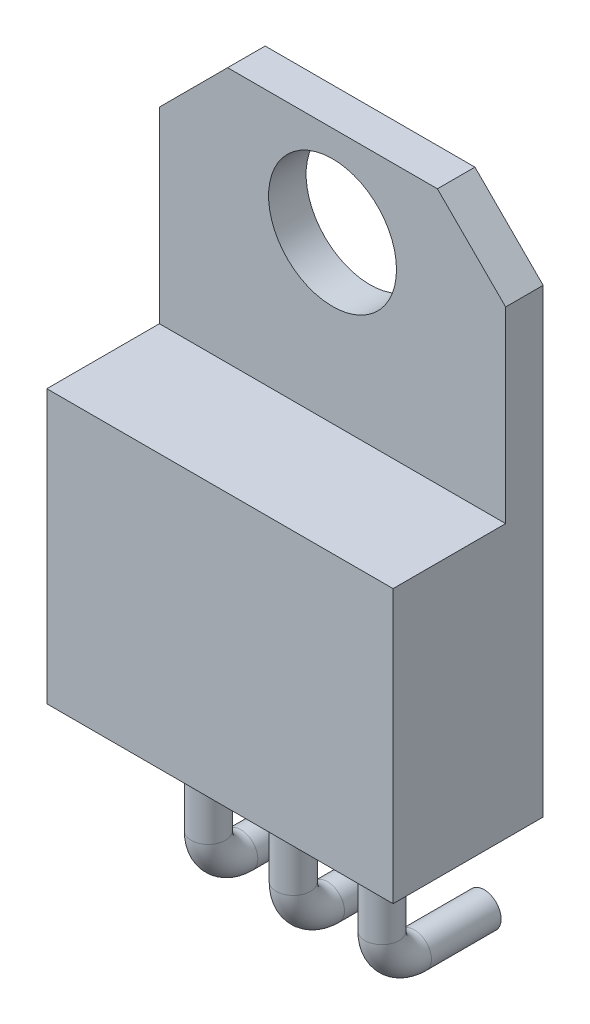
from build123d import *

# Parameters (mm, degrees)
ESQUISSE1_W             = 10.15
ESQUISSE1_H             = 15.5
EXTRUSION1_DEPTH        = 1.1
ESQUISSE2_R             = 1.875
ENL_V_MAT_EXTRU_1_DEPTH = 19.560239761
CHANFREIN1_SIZE         = 2
ESQUISSE3_W             = 10.15
ESQUISSE3_H             = 8
EXTRUSION2_DEPTH        = 3.3
ESQUISSE5_R             = 0.5
ESQUISSE9_R             = 0.5


with BuildPart() as part:
    # Esquisse1 → Extrusion1 (new body)
    with BuildSketch(Plane.XY):
        with Locations((5.075, 7.75)):
            Rectangle(ESQUISSE1_W, ESQUISSE1_H)
    extrude(amount=EXTRUSION1_DEPTH)

    # Esquisse2 → Enl_v. mat.-Extru.1 (cut, through all)
    with BuildSketch(Plane.XY.offset(1.1)):
        with Locations((5.075, 12.85)):
            Circle(ESQUISSE2_R)
    extrude(amount=-ENL_V_MAT_EXTRU_1_DEPTH, mode=Mode.SUBTRACT)

    # Chanfrein1
    chanfrein1_edges = [part.edges().sort_by_distance(p)[0] for p in [
        (0, 15.5, 0.55),
        (10.15, 15.5, 0.55),
    ]]
    chamfer(chanfrein1_edges, length=CHANFREIN1_SIZE)

    # Esquisse3 → Extrusion2 (add)
    with BuildSketch(Plane.XY.offset(1.1)):
        with Locations((5.075, 4)):
            Rectangle(ESQUISSE3_W, ESQUISSE3_H)
    extrude(amount=EXTRUSION2_DEPTH)

    # Balayage1: sweep along a path in Esquisse8
    with BuildLine(Plane(origin=(2.54, 0, 0), x_dir=(0, 0, -1), z_dir=(1, 0, 0))) as balayage1_path:
        Line((-2.25, 0), (-2.25, -3.05))
        ThreePointArc((-2.25, -3.05), (-1.957106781, -3.757106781), (-1.25, -4.05))
        Line((-1.25, -4.05), (0.791981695, -4.05))
    # Esquisse5 → Balayage1 (sweep)
    with BuildSketch(Plane.XZ):
        with Locations((2.535, 2.2)):
            Circle(ESQUISSE5_R)
    balayage1 = sweep(path=balayage1_path.line)

    # Balayage2: sweep along a path in Esquisse10
    with BuildLine(Plane(origin=(5.08, 0, 0), x_dir=(0, 0, -1), z_dir=(1, 0, 0))) as balayage2_path:
        Line((-2.25, 0), (-2.25, -3.05))
        ThreePointArc((-2.25, -3.05), (-1.957106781, -3.757106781), (-1.25, -4.05))
        Line((-1.25, -4.05), (0.791981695, -4.05))
    # Esquisse9 → Balayage2 (sweep)
    with BuildSketch(Plane.XZ):
        with Locations((5.075, 2.25)):
            Circle(ESQUISSE9_R)
    sweep(path=balayage2_path.line)

    # Sym_trie1: Balayage1 across plane
    add(balayage1.mirror(Plane(origin=(5.08, 0, 0), x_dir=(0, 0, 1), z_dir=(1, 0, 0))))


solid = part.part
